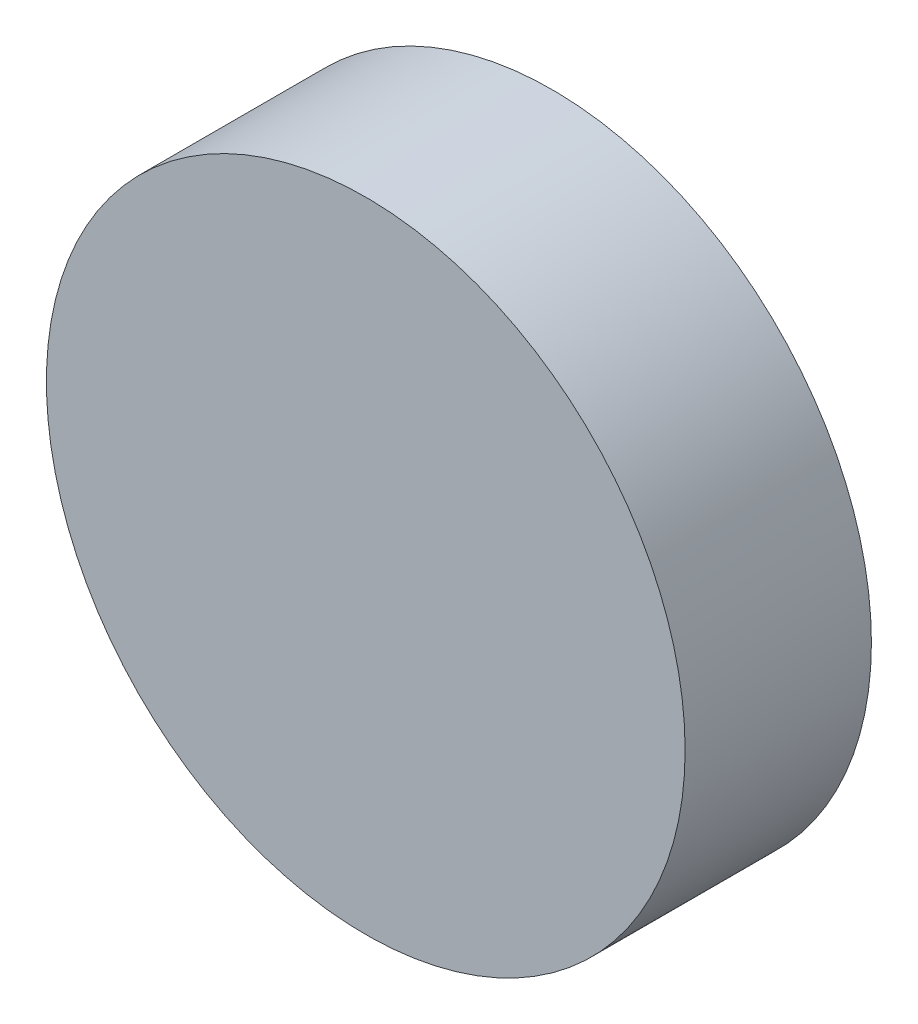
ISO-10303-21;
HEADER;
FILE_DESCRIPTION(('STEP AP214'),'2;1');
FILE_NAME('part.step','',(''),(''),'','','');
FILE_SCHEMA(('AUTOMOTIVE_DESIGN { 1 0 10303 214 1 1 1 1 }'));
ENDSEC;
DATA;
#1=APPLICATION_CONTEXT('core data for automotive mechanical design processes');
#2=APPLICATION_PROTOCOL_DEFINITION('international standard','automotive_design',2000,#1);
#3=PRODUCT_CONTEXT('',#1,'mechanical');
#4=PRODUCT('Part','Part','',(#3));
#5=PRODUCT_RELATED_PRODUCT_CATEGORY('part','',(#4));
#6=PRODUCT_DEFINITION_FORMATION('','',#4);
#7=PRODUCT_DEFINITION_CONTEXT('part definition',#1,'design');
#8=PRODUCT_DEFINITION('design','',#6,#7);
#9=PRODUCT_DEFINITION_SHAPE('','',#8);
#10=(LENGTH_UNIT() NAMED_UNIT(*) SI_UNIT(.MILLI.,.METRE.));
#11=(NAMED_UNIT(*) PLANE_ANGLE_UNIT() SI_UNIT($,.RADIAN.));
#12=(NAMED_UNIT(*) SI_UNIT($,.STERADIAN.) SOLID_ANGLE_UNIT());
#13=UNCERTAINTY_MEASURE_WITH_UNIT(LENGTH_MEASURE(1.E-05),#10,'distance_accuracy_value','');
#14=(GEOMETRIC_REPRESENTATION_CONTEXT(3) GLOBAL_UNCERTAINTY_ASSIGNED_CONTEXT((#13)) GLOBAL_UNIT_ASSIGNED_CONTEXT((#10,
#11,#12)) REPRESENTATION_CONTEXT('',''));
#15=CARTESIAN_POINT('',(0.,0.,0.));
#16=DIRECTION('',(0.,0.,1.));
#17=DIRECTION('',(1.,0.,0.));
#18=AXIS2_PLACEMENT_3D('',#15,#16,#17);
#19=CARTESIAN_POINT('',(0.,0.,3.5));
#20=DIRECTION('',(0.,0.,-1.));
#21=DIRECTION('',(-1.,0.,0.));
#22=AXIS2_PLACEMENT_3D('',#19,#20,#21);
#23=CYLINDRICAL_SURFACE('',#22,6.);
#24=CARTESIAN_POINT('',(0.,0.,3.5));
#25=DIRECTION('',(0.,0.,1.));
#26=DIRECTION('',(1.,0.,0.));
#27=AXIS2_PLACEMENT_3D('',#24,#25,#26);
#28=CIRCLE('',#27,6.);
#29=CARTESIAN_POINT('',(6.,0.,3.5));
#30=VERTEX_POINT('',#29);
#31=EDGE_CURVE('E10',#30,#30,#28,.T.);
#32=ORIENTED_EDGE('',*,*,#31,.F.);
#33=EDGE_LOOP('',(#32));
#34=FACE_BOUND('',#33,.T.);
#35=CARTESIAN_POINT('',(0.,0.,0.));
#36=DIRECTION('',(0.,0.,1.));
#37=DIRECTION('',(1.,0.,0.));
#38=AXIS2_PLACEMENT_3D('',#35,#36,#37);
#39=CIRCLE('',#38,6.);
#40=CARTESIAN_POINT('',(6.,0.,0.));
#41=VERTEX_POINT('',#40);
#42=EDGE_CURVE('E30',#41,#41,#39,.T.);
#43=ORIENTED_EDGE('',*,*,#42,.T.);
#44=EDGE_LOOP('',(#43));
#45=FACE_BOUND('',#44,.T.);
#46=ADVANCED_FACE('F24',(#34,#45),#23,.T.);
#47=CARTESIAN_POINT('',(0.,0.,3.5));
#48=DIRECTION('',(0.,0.,1.));
#49=DIRECTION('',(1.,0.,0.));
#50=AXIS2_PLACEMENT_3D('',#47,#48,#49);
#51=PLANE('',#50);
#52=ORIENTED_EDGE('',*,*,#31,.T.);
#53=EDGE_LOOP('',(#52));
#54=FACE_BOUND('',#53,.T.);
#55=ADVANCED_FACE('F39',(#54),#51,.T.);
#56=CARTESIAN_POINT('',(0.,0.,0.));
#57=DIRECTION('',(0.,0.,1.));
#58=DIRECTION('',(1.,0.,0.));
#59=AXIS2_PLACEMENT_3D('',#56,#57,#58);
#60=PLANE('',#59);
#61=ORIENTED_EDGE('',*,*,#42,.F.);
#62=EDGE_LOOP('',(#61));
#63=FACE_BOUND('',#62,.T.);
#64=ADVANCED_FACE('F37',(#63),#60,.F.);
#65=CLOSED_SHELL('',(#46,#55,#64));
#66=MANIFOLD_SOLID_BREP('B2',#65);
#67=ADVANCED_BREP_SHAPE_REPRESENTATION('',(#18,#66),#14);
#68=SHAPE_DEFINITION_REPRESENTATION(#9,#67);
ENDSEC;
END-ISO-10303-21;
